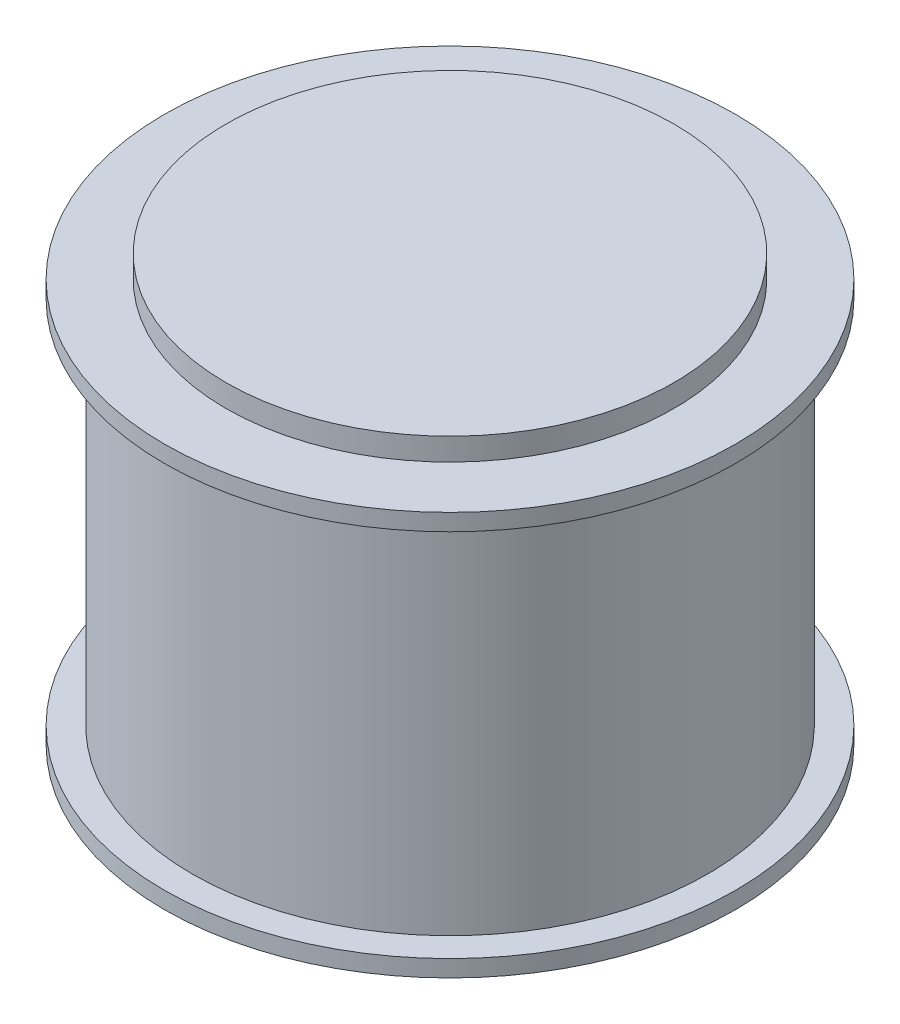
ISO-10303-21;
HEADER;
FILE_DESCRIPTION(('STEP AP214'),'2;1');
FILE_NAME('part.step','',(''),(''),'','','');
FILE_SCHEMA(('AUTOMOTIVE_DESIGN { 1 0 10303 214 1 1 1 1 }'));
ENDSEC;
DATA;
#1=APPLICATION_CONTEXT('core data for automotive mechanical design processes');
#2=APPLICATION_PROTOCOL_DEFINITION('international standard','automotive_design',2000,#1);
#3=PRODUCT_CONTEXT('',#1,'mechanical');
#4=PRODUCT('Part','Part','',(#3));
#5=PRODUCT_RELATED_PRODUCT_CATEGORY('part','',(#4));
#6=PRODUCT_DEFINITION_FORMATION('','',#4);
#7=PRODUCT_DEFINITION_CONTEXT('part definition',#1,'design');
#8=PRODUCT_DEFINITION('design','',#6,#7);
#9=PRODUCT_DEFINITION_SHAPE('','',#8);
#10=(LENGTH_UNIT() NAMED_UNIT(*) SI_UNIT(.MILLI.,.METRE.));
#11=(NAMED_UNIT(*) PLANE_ANGLE_UNIT() SI_UNIT($,.RADIAN.));
#12=(NAMED_UNIT(*) SI_UNIT($,.STERADIAN.) SOLID_ANGLE_UNIT());
#13=UNCERTAINTY_MEASURE_WITH_UNIT(LENGTH_MEASURE(1.E-05),#10,'distance_accuracy_value','');
#14=(GEOMETRIC_REPRESENTATION_CONTEXT(3) GLOBAL_UNCERTAINTY_ASSIGNED_CONTEXT((#13)) GLOBAL_UNIT_ASSIGNED_CONTEXT((#10,
#11,#12)) REPRESENTATION_CONTEXT('',''));
#15=CARTESIAN_POINT('',(0.,0.,0.));
#16=DIRECTION('',(0.,0.,1.));
#17=DIRECTION('',(1.,0.,0.));
#18=AXIS2_PLACEMENT_3D('',#15,#16,#17);
#19=CARTESIAN_POINT('',(0.,33.,0.));
#20=DIRECTION('',(0.,-1.,0.));
#21=DIRECTION('',(0.,0.,-1.));
#22=AXIS2_PLACEMENT_3D('',#19,#20,#21);
#23=CYLINDRICAL_SURFACE('',#22,23.);
#24=CARTESIAN_POINT('',(0.,33.,0.));
#25=DIRECTION('',(0.,1.,0.));
#26=DIRECTION('',(0.,0.,1.));
#27=AXIS2_PLACEMENT_3D('',#24,#25,#26);
#28=CIRCLE('',#27,23.);
#29=CARTESIAN_POINT('',(0.,33.,23.));
#30=VERTEX_POINT('',#29);
#31=EDGE_CURVE('E46',#30,#30,#28,.T.);
#32=ORIENTED_EDGE('',*,*,#31,.F.);
#33=EDGE_LOOP('',(#32));
#34=FACE_BOUND('',#33,.T.);
#35=CARTESIAN_POINT('',(0.,0.,0.));
#36=DIRECTION('',(0.,1.,0.));
#37=DIRECTION('',(0.,0.,1.));
#38=AXIS2_PLACEMENT_3D('',#35,#36,#37);
#39=CIRCLE('',#38,23.);
#40=CARTESIAN_POINT('',(0.,0.,23.));
#41=VERTEX_POINT('',#40);
#42=EDGE_CURVE('E42',#41,#41,#39,.T.);
#43=ORIENTED_EDGE('',*,*,#42,.T.);
#44=EDGE_LOOP('',(#43));
#45=FACE_BOUND('',#44,.T.);
#46=ADVANCED_FACE('F39',(#34,#45),#23,.T.);
#47=CARTESIAN_POINT('',(0.,34.5,0.));
#48=DIRECTION('',(0.,-1.,0.));
#49=DIRECTION('',(0.,0.,-1.));
#50=AXIS2_PLACEMENT_3D('',#47,#48,#49);
#51=CYLINDRICAL_SURFACE('',#50,25.5);
#52=CARTESIAN_POINT('',(0.,34.5,0.));
#53=DIRECTION('',(0.,1.,0.));
#54=DIRECTION('',(0.,0.,1.));
#55=AXIS2_PLACEMENT_3D('',#52,#53,#54);
#56=CIRCLE('',#55,25.5);
#57=CARTESIAN_POINT('',(0.,34.5,25.5));
#58=VERTEX_POINT('',#57);
#59=EDGE_CURVE('E51',#58,#58,#56,.T.);
#60=ORIENTED_EDGE('',*,*,#59,.F.);
#61=EDGE_LOOP('',(#60));
#62=FACE_BOUND('',#61,.T.);
#63=CARTESIAN_POINT('',(0.,33.,0.));
#64=DIRECTION('',(0.,1.,0.));
#65=DIRECTION('',(0.,0.,1.));
#66=AXIS2_PLACEMENT_3D('',#63,#64,#65);
#67=CIRCLE('',#66,25.5);
#68=CARTESIAN_POINT('',(0.,33.,25.5));
#69=VERTEX_POINT('',#68);
#70=EDGE_CURVE('E58',#69,#69,#67,.T.);
#71=ORIENTED_EDGE('',*,*,#70,.T.);
#72=EDGE_LOOP('',(#71));
#73=FACE_BOUND('',#72,.T.);
#74=ADVANCED_FACE('F95',(#62,#73),#51,.T.);
#75=CARTESIAN_POINT('',(0.,34.5,0.));
#76=DIRECTION('',(0.,1.,0.));
#77=DIRECTION('',(0.,0.,1.));
#78=AXIS2_PLACEMENT_3D('',#75,#76,#77);
#79=PLANE('',#78);
#80=CARTESIAN_POINT('',(0.,34.5,0.));
#81=DIRECTION('',(0.,1.,0.));
#82=DIRECTION('',(0.,0.,1.));
#83=AXIS2_PLACEMENT_3D('',#80,#81,#82);
#84=CIRCLE('',#83,20.);
#85=CARTESIAN_POINT('',(0.,34.5,20.));
#86=VERTEX_POINT('',#85);
#87=EDGE_CURVE('E10',#86,#86,#84,.T.);
#88=ORIENTED_EDGE('',*,*,#87,.F.);
#89=EDGE_LOOP('',(#88));
#90=FACE_BOUND('',#89,.T.);
#91=ORIENTED_EDGE('',*,*,#59,.T.);
#92=EDGE_LOOP('',(#91));
#93=FACE_BOUND('',#92,.T.);
#94=ADVANCED_FACE('F100',(#90,#93),#79,.T.);
#95=CARTESIAN_POINT('',(0.,33.,0.));
#96=DIRECTION('',(0.,1.,0.));
#97=DIRECTION('',(0.,0.,1.));
#98=AXIS2_PLACEMENT_3D('',#95,#96,#97);
#99=PLANE('',#98);
#100=ORIENTED_EDGE('',*,*,#31,.T.);
#101=EDGE_LOOP('',(#100));
#102=FACE_BOUND('',#101,.T.);
#103=ORIENTED_EDGE('',*,*,#70,.F.);
#104=EDGE_LOOP('',(#103));
#105=FACE_BOUND('',#104,.T.);
#106=ADVANCED_FACE('F104',(#102,#105),#99,.F.);
#107=CARTESIAN_POINT('',(0.,35.5,0.));
#108=DIRECTION('',(0.,-1.,0.));
#109=DIRECTION('',(0.,0.,-1.));
#110=AXIS2_PLACEMENT_3D('',#107,#108,#109);
#111=CYLINDRICAL_SURFACE('',#110,20.);
#112=ORIENTED_EDGE('',*,*,#87,.T.);
#113=EDGE_LOOP('',(#112));
#114=FACE_BOUND('',#113,.T.);
#115=CARTESIAN_POINT('',(0.,36.5,0.));
#116=DIRECTION('',(0.,1.,0.));
#117=DIRECTION('',(0.,0.,1.));
#118=AXIS2_PLACEMENT_3D('',#115,#116,#117);
#119=CIRCLE('',#118,20.);
#120=CARTESIAN_POINT('',(0.,36.5,20.));
#121=VERTEX_POINT('',#120);
#122=EDGE_CURVE('E54',#121,#121,#119,.T.);
#123=ORIENTED_EDGE('',*,*,#122,.F.);
#124=EDGE_LOOP('',(#123));
#125=FACE_BOUND('',#124,.T.);
#126=ADVANCED_FACE('F107',(#114,#125),#111,.T.);
#127=CARTESIAN_POINT('',(0.,36.5,0.));
#128=DIRECTION('',(0.,1.,0.));
#129=DIRECTION('',(0.,0.,1.));
#130=AXIS2_PLACEMENT_3D('',#127,#128,#129);
#131=PLANE('',#130);
#132=ORIENTED_EDGE('',*,*,#122,.T.);
#133=EDGE_LOOP('',(#132));
#134=FACE_BOUND('',#133,.T.);
#135=ADVANCED_FACE('F113',(#134),#131,.T.);
#136=CARTESIAN_POINT('',(0.,-1.5,0.));
#137=DIRECTION('',(0.,1.,0.));
#138=DIRECTION('',(0.,0.,1.));
#139=AXIS2_PLACEMENT_3D('',#136,#137,#138);
#140=CYLINDRICAL_SURFACE('',#139,25.5);
#141=CARTESIAN_POINT('',(0.,-1.5,0.));
#142=DIRECTION('',(0.,1.,0.));
#143=DIRECTION('',(0.,0.,1.));
#144=AXIS2_PLACEMENT_3D('',#141,#142,#143);
#145=CIRCLE('',#144,25.5);
#146=CARTESIAN_POINT('',(0.,-1.5,25.5));
#147=VERTEX_POINT('',#146);
#148=EDGE_CURVE('E66',#147,#147,#145,.T.);
#149=ORIENTED_EDGE('',*,*,#148,.T.);
#150=EDGE_LOOP('',(#149));
#151=FACE_BOUND('',#150,.T.);
#152=CARTESIAN_POINT('',(0.,0.,0.));
#153=DIRECTION('',(0.,1.,0.));
#154=DIRECTION('',(0.,0.,1.));
#155=AXIS2_PLACEMENT_3D('',#152,#153,#154);
#156=CIRCLE('',#155,25.5);
#157=CARTESIAN_POINT('',(0.,0.,25.5));
#158=VERTEX_POINT('',#157);
#159=EDGE_CURVE('E70',#158,#158,#156,.T.);
#160=ORIENTED_EDGE('',*,*,#159,.F.);
#161=EDGE_LOOP('',(#160));
#162=FACE_BOUND('',#161,.T.);
#163=ADVANCED_FACE('F120',(#151,#162),#140,.T.);
#164=CARTESIAN_POINT('',(0.,-1.5,0.));
#165=DIRECTION('',(0.,-1.,0.));
#166=DIRECTION('',(0.,0.,1.));
#167=AXIS2_PLACEMENT_3D('',#164,#165,#166);
#168=PLANE('',#167);
#169=CARTESIAN_POINT('',(0.,-1.5,0.));
#170=DIRECTION('',(0.,1.,0.));
#171=DIRECTION('',(0.,0.,1.));
#172=AXIS2_PLACEMENT_3D('',#169,#170,#171);
#173=CIRCLE('',#172,20.);
#174=CARTESIAN_POINT('',(0.,-1.5,20.));
#175=VERTEX_POINT('',#174);
#176=EDGE_CURVE('E75',#175,#175,#173,.T.);
#177=ORIENTED_EDGE('',*,*,#176,.T.);
#178=EDGE_LOOP('',(#177));
#179=FACE_BOUND('',#178,.T.);
#180=ORIENTED_EDGE('',*,*,#148,.F.);
#181=EDGE_LOOP('',(#180));
#182=FACE_BOUND('',#181,.T.);
#183=ADVANCED_FACE('F123',(#179,#182),#168,.T.);
#184=CARTESIAN_POINT('',(0.,0.,0.));
#185=DIRECTION('',(0.,-1.,0.));
#186=DIRECTION('',(0.,0.,1.));
#187=AXIS2_PLACEMENT_3D('',#184,#185,#186);
#188=PLANE('',#187);
#189=ORIENTED_EDGE('',*,*,#42,.F.);
#190=EDGE_LOOP('',(#189));
#191=FACE_BOUND('',#190,.T.);
#192=ORIENTED_EDGE('',*,*,#159,.T.);
#193=EDGE_LOOP('',(#192));
#194=FACE_BOUND('',#193,.T.);
#195=ADVANCED_FACE('F91',(#191,#194),#188,.F.);
#196=CARTESIAN_POINT('',(0.,-2.5,0.));
#197=DIRECTION('',(0.,1.,0.));
#198=DIRECTION('',(0.,0.,1.));
#199=AXIS2_PLACEMENT_3D('',#196,#197,#198);
#200=CYLINDRICAL_SURFACE('',#199,20.);
#201=ORIENTED_EDGE('',*,*,#176,.F.);
#202=EDGE_LOOP('',(#201));
#203=FACE_BOUND('',#202,.T.);
#204=CARTESIAN_POINT('',(0.,-3.5,0.));
#205=DIRECTION('',(0.,1.,0.));
#206=DIRECTION('',(0.,0.,1.));
#207=AXIS2_PLACEMENT_3D('',#204,#205,#206);
#208=CIRCLE('',#207,20.);
#209=CARTESIAN_POINT('',(0.,-3.5,20.));
#210=VERTEX_POINT('',#209);
#211=EDGE_CURVE('E79',#210,#210,#208,.T.);
#212=ORIENTED_EDGE('',*,*,#211,.T.);
#213=EDGE_LOOP('',(#212));
#214=FACE_BOUND('',#213,.T.);
#215=ADVANCED_FACE('F83',(#203,#214),#200,.T.);
#216=CARTESIAN_POINT('',(0.,-3.5,0.));
#217=DIRECTION('',(0.,-1.,0.));
#218=DIRECTION('',(0.,0.,1.));
#219=AXIS2_PLACEMENT_3D('',#216,#217,#218);
#220=PLANE('',#219);
#221=ORIENTED_EDGE('',*,*,#211,.F.);
#222=EDGE_LOOP('',(#221));
#223=FACE_BOUND('',#222,.T.);
#224=ADVANCED_FACE('F85',(#223),#220,.T.);
#225=CLOSED_SHELL('',(#46,#74,#94,#106,#126,#135,#163,#183,#195,#215,#224));
#226=MANIFOLD_SOLID_BREP('B2',#225);
#227=ADVANCED_BREP_SHAPE_REPRESENTATION('',(#18,#226),#14);
#228=SHAPE_DEFINITION_REPRESENTATION(#9,#227);
ENDSEC;
END-ISO-10303-21;
